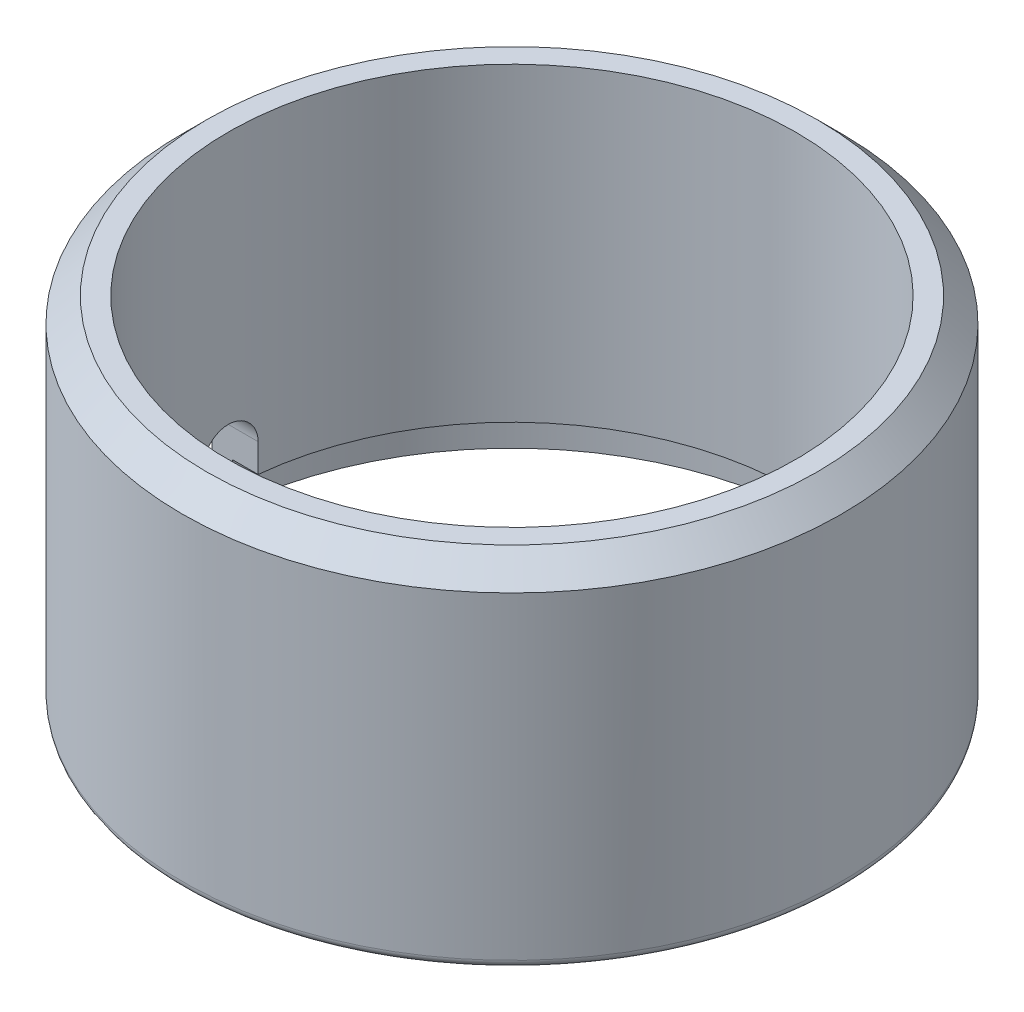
ISO-10303-21;
HEADER;
FILE_DESCRIPTION(('STEP AP214'),'2;1');
FILE_NAME('part.step','',(''),(''),'','','');
FILE_SCHEMA(('AUTOMOTIVE_DESIGN { 1 0 10303 214 1 1 1 1 }'));
ENDSEC;
DATA;
#1=APPLICATION_CONTEXT('core data for automotive mechanical design processes');
#2=APPLICATION_PROTOCOL_DEFINITION('international standard','automotive_design',2000,#1);
#3=PRODUCT_CONTEXT('',#1,'mechanical');
#4=PRODUCT('Part','Part','',(#3));
#5=PRODUCT_RELATED_PRODUCT_CATEGORY('part','',(#4));
#6=PRODUCT_DEFINITION_FORMATION('','',#4);
#7=PRODUCT_DEFINITION_CONTEXT('part definition',#1,'design');
#8=PRODUCT_DEFINITION('design','',#6,#7);
#9=PRODUCT_DEFINITION_SHAPE('','',#8);
#10=(LENGTH_UNIT() NAMED_UNIT(*) SI_UNIT(.MILLI.,.METRE.));
#11=(NAMED_UNIT(*) PLANE_ANGLE_UNIT() SI_UNIT($,.RADIAN.));
#12=(NAMED_UNIT(*) SI_UNIT($,.STERADIAN.) SOLID_ANGLE_UNIT());
#13=UNCERTAINTY_MEASURE_WITH_UNIT(LENGTH_MEASURE(1.E-05),#10,'distance_accuracy_value','');
#14=(GEOMETRIC_REPRESENTATION_CONTEXT(3) GLOBAL_UNCERTAINTY_ASSIGNED_CONTEXT((#13)) GLOBAL_UNIT_ASSIGNED_CONTEXT((#10,
#11,#12)) REPRESENTATION_CONTEXT('',''));
#15=CARTESIAN_POINT('',(0.,0.,0.));
#16=DIRECTION('',(0.,0.,1.));
#17=DIRECTION('',(1.,0.,0.));
#18=AXIS2_PLACEMENT_3D('',#15,#16,#17);
#19=CARTESIAN_POINT('',(0.,21.6,0.));
#20=DIRECTION('',(0.,-1.,0.));
#21=DIRECTION('',(0.,0.,-1.));
#22=AXIS2_PLACEMENT_3D('',#19,#20,#21);
#23=CYLINDRICAL_SURFACE('',#22,17.475);
#24=CARTESIAN_POINT('',(0.,21.6,0.));
#25=DIRECTION('',(0.,-1.,0.));
#26=DIRECTION('',(0.,0.,-1.));
#27=AXIS2_PLACEMENT_3D('',#24,#25,#26);
#28=CIRCLE('',#27,17.475);
#29=CARTESIAN_POINT('',(0.,21.6,-17.475));
#30=VERTEX_POINT('',#29);
#31=EDGE_CURVE('E231',#30,#30,#28,.T.);
#32=ORIENTED_EDGE('',*,*,#31,.F.);
#33=EDGE_LOOP('',(#32));
#34=FACE_BOUND('',#33,.T.);
#35=CARTESIAN_POINT('',(-17.3871540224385,4.24999999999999,-1.75));
#36=CARTESIAN_POINT('',(-17.3871528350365,4.29910463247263,-1.74999981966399));
#37=CARTESIAN_POINT('',(-17.3873623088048,4.34818562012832,-1.74793190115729));
#38=CARTESIAN_POINT('',(-17.3881900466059,4.44599394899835,-1.73968309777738));
#39=CARTESIAN_POINT('',(-17.3888082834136,4.49472131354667,-1.73350248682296));
#40=CARTESIAN_POINT('',(-17.3912543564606,4.63974372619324,-1.70885548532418));
#41=CARTESIAN_POINT('',(-17.3936736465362,4.73506354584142,-1.68428373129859));
#42=CARTESIAN_POINT('',(-17.3998189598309,4.92019736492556,-1.61955831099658));
#43=CARTESIAN_POINT('',(-17.4035454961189,5.01000918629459,-1.57939852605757));
#44=CARTESIAN_POINT('',(-17.4118838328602,5.18162297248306,-1.48464792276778));
#45=CARTESIAN_POINT('',(-17.4164955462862,5.26342572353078,-1.43005852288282));
#46=CARTESIAN_POINT('',(-17.4261027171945,5.41697650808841,-1.30779578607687));
#47=CARTESIAN_POINT('',(-17.4310993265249,5.48869239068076,-1.24008217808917));
#48=CARTESIAN_POINT('',(-17.4409037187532,5.61977390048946,-1.09356381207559));
#49=CARTESIAN_POINT('',(-17.4457114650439,5.67913714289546,-1.01475691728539));
#50=CARTESIAN_POINT('',(-17.4546082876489,5.78393877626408,-0.848085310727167));
#51=CARTESIAN_POINT('',(-17.4586956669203,5.82934446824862,-0.760199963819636));
#52=CARTESIAN_POINT('',(-17.4656749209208,5.90471813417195,-0.578022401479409));
#53=CARTESIAN_POINT('',(-17.468567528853,5.93469557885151,-0.483734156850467));
#54=CARTESIAN_POINT('',(-17.4721108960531,5.97097076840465,-0.324065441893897));
#55=CARTESIAN_POINT('',(-17.4731890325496,5.98184864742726,-0.259697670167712));
#56=CARTESIAN_POINT('',(-17.474635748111,5.99636310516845,-0.130229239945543));
#57=CARTESIAN_POINT('',(-17.4750052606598,6.00000921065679,-0.0651296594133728));
#58=CARTESIAN_POINT('',(-17.475,6.,0.));
#59=B_SPLINE_CURVE_WITH_KNOTS('',3,(#35,#36,#37,#38,#39,#40,#41,#42,#43,#44,#45,#46,#47,#48,#49,
#50,#51,#52,#53,#54,#55,#56,#57,#58),.UNSPECIFIED.,.F.,.F.,(4,2,2,2,2,2,2,2,2,2,2,4),(0.,
0.147223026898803,0.294436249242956,0.588316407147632,0.882312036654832,1.17627877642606,
1.4711622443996,1.76610259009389,2.06172873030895,2.35717318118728,2.55265859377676,
2.74788631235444),.UNSPECIFIED.);
#60=CARTESIAN_POINT('',(-17.3871540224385,4.24999999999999,-1.75));
#61=VERTEX_POINT('',#60);
#62=CARTESIAN_POINT('',(-17.475,6.,0.));
#63=VERTEX_POINT('',#62);
#64=EDGE_CURVE('E178',#61,#63,#59,.T.);
#65=ORIENTED_EDGE('',*,*,#64,.F.);
#66=DIRECTION('',(0.,-1.,0.));
#67=VECTOR('',#66,1.);
#68=CARTESIAN_POINT('',(-17.3871540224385,21.6,-1.75));
#69=LINE('',#68,#67);
#70=CARTESIAN_POINT('',(-17.3871540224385,2.5,-1.75));
#71=VERTEX_POINT('',#70);
#72=EDGE_CURVE('E262',#71,#61,#69,.F.);
#73=ORIENTED_EDGE('',*,*,#72,.F.);
#74=CARTESIAN_POINT('',(0.,2.5,0.));
#75=DIRECTION('',(0.,-1.,0.));
#76=DIRECTION('',(0.,0.,-1.));
#77=AXIS2_PLACEMENT_3D('',#74,#75,#76);
#78=CIRCLE('',#77,17.475);
#79=CARTESIAN_POINT('',(-17.3871540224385,2.5,1.75));
#80=VERTEX_POINT('',#79);
#81=EDGE_CURVE('E235',#80,#71,#78,.F.);
#82=ORIENTED_EDGE('',*,*,#81,.F.);
#83=DIRECTION('',(0.,-1.,0.));
#84=VECTOR('',#83,1.);
#85=CARTESIAN_POINT('',(-17.3871540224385,21.6,1.75));
#86=LINE('',#85,#84);
#87=CARTESIAN_POINT('',(-17.3871540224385,4.25499999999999,1.75));
#88=VERTEX_POINT('',#87);
#89=EDGE_CURVE('E55',#88,#80,#86,.T.);
#90=ORIENTED_EDGE('',*,*,#89,.F.);
#91=CARTESIAN_POINT('',(-17.4749992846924,6.,0.00499999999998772));
#92=CARTESIAN_POINT('',(-17.4749864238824,5.99999981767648,0.0539665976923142));
#93=CARTESIAN_POINT('',(-17.474765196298,5.99793761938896,0.102909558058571));
#94=CARTESIAN_POINT('',(-17.473918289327,5.98971164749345,0.200442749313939));
#95=CARTESIAN_POINT('',(-17.4732926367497,5.98354814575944,0.249033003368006));
#96=CARTESIAN_POINT('',(-17.470830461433,5.95896934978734,0.393647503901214));
#97=CARTESIAN_POINT('',(-17.4684085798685,5.93446557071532,0.488699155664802));
#98=CARTESIAN_POINT('',(-17.4622689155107,5.86991912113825,0.673311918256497));
#99=CARTESIAN_POINT('',(-17.4585506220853,5.82987032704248,0.762870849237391));
#100=CARTESIAN_POINT('',(-17.4502323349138,5.73538169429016,0.934000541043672));
#101=CARTESIAN_POINT('',(-17.4456324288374,5.68094328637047,1.01557209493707));
#102=CARTESIAN_POINT('',(-17.4360464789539,5.55902164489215,1.16868446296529));
#103=CARTESIAN_POINT('',(-17.4310592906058,5.49149878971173,1.24019364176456));
#104=CARTESIAN_POINT('',(-17.421267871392,5.3453940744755,1.37089643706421));
#105=CARTESIAN_POINT('',(-17.4164636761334,5.2668100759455,1.43008766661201));
#106=CARTESIAN_POINT('',(-17.4075685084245,5.10061045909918,1.53458473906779));
#107=CARTESIAN_POINT('',(-17.4034792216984,5.01297424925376,1.57985794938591));
#108=CARTESIAN_POINT('',(-17.3964938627,4.83131360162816,1.6550104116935));
#109=CARTESIAN_POINT('',(-17.3935970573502,4.73729313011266,1.68489912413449));
#110=CARTESIAN_POINT('',(-17.3900482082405,4.57808880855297,1.72106286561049));
#111=CARTESIAN_POINT('',(-17.3889682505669,4.51391494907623,1.73190622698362));
#112=CARTESIAN_POINT('',(-17.3875189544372,4.38483667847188,1.74637463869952));
#113=CARTESIAN_POINT('',(-17.3871486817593,4.31993334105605,1.75000917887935));
#114=CARTESIAN_POINT('',(-17.3871540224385,4.25499999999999,1.75));
#115=B_SPLINE_CURVE_WITH_KNOTS('',3,(#91,#92,#93,#94,#95,#96,#97,#98,#99,#100,#101,#102,#103,
#104,#105,#106,#107,#108,#109,#110,#111,#112,#113,#114),.UNSPECIFIED.,.F.,.F.,(4,2,2,2,2,2,2,2,
2,2,2,4),(0.,0.146809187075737,0.293608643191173,0.586663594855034,0.879834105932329,
1.17297547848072,1.46701880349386,1.76111905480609,2.05590369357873,2.35050684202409,
2.54540282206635,2.74004206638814),.UNSPECIFIED.);
#116=CARTESIAN_POINT('',(-17.4749992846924,6.,0.00499999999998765));
#117=VERTEX_POINT('',#116);
#118=EDGE_CURVE('E135',#117,#88,#115,.T.);
#119=ORIENTED_EDGE('',*,*,#118,.F.);
#120=CARTESIAN_POINT('',(0.,6.,0.));
#121=DIRECTION('',(0.,1.,0.));
#122=DIRECTION('',(0.,0.,1.));
#123=AXIS2_PLACEMENT_3D('',#120,#121,#122);
#124=CIRCLE('',#123,17.475);
#125=EDGE_CURVE('E109',#63,#117,#124,.T.);
#126=ORIENTED_EDGE('',*,*,#125,.F.);
#127=EDGE_LOOP('',(#65,#73,#82,#90,#119,#126));
#128=FACE_BOUND('',#127,.T.);
#129=ADVANCED_FACE('F32',(#34,#128),#23,.F.);
#130=CARTESIAN_POINT('',(0.,21.6,0.));
#131=DIRECTION('',(0.,-1.,0.));
#132=DIRECTION('',(0.,0.,-1.));
#133=AXIS2_PLACEMENT_3D('',#130,#131,#132);
#134=CYLINDRICAL_SURFACE('',#133,20.3);
#135=CARTESIAN_POINT('',(0.,0.5,0.));
#136=DIRECTION('',(0.,1.,0.));
#137=DIRECTION('',(0.,0.,1.));
#138=AXIS2_PLACEMENT_3D('',#135,#136,#137);
#139=CIRCLE('',#138,20.3);
#140=CARTESIAN_POINT('',(-20.2244282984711,0.5,1.75));
#141=VERTEX_POINT('',#140);
#142=CARTESIAN_POINT('',(-20.2244282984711,0.5,-1.75));
#143=VERTEX_POINT('',#142);
#144=EDGE_CURVE('E40',#141,#143,#139,.T.);
#145=ORIENTED_EDGE('',*,*,#144,.T.);
#146=DIRECTION('',(0.,-1.,0.));
#147=VECTOR('',#146,1.);
#148=CARTESIAN_POINT('',(-20.2244282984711,21.6,-1.75));
#149=LINE('',#148,#147);
#150=CARTESIAN_POINT('',(-20.2244282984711,4.24999999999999,-1.75));
#151=VERTEX_POINT('',#150);
#152=EDGE_CURVE('E114',#151,#143,#149,.T.);
#153=ORIENTED_EDGE('',*,*,#152,.F.);
#154=CARTESIAN_POINT('',(-20.3,6.,0.));
#155=CARTESIAN_POINT('',(-20.3000009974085,5.99999978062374,-0.0491389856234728));
#156=CARTESIAN_POINT('',(-20.2998213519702,5.99792900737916,-0.0982543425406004));
#157=CARTESIAN_POINT('',(-20.2991113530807,5.98966855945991,-0.196131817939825));
#158=CARTESIAN_POINT('',(-20.2985810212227,5.98347913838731,-0.244893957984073));
#159=CARTESIAN_POINT('',(-20.2964823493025,5.95879549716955,-0.390026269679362));
#160=CARTESIAN_POINT('',(-20.2944062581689,5.93418571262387,-0.485421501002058));
#161=CARTESIAN_POINT('',(-20.2891294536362,5.8693534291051,-0.670705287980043));
#162=CARTESIAN_POINT('',(-20.2859282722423,5.82912443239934,-0.760591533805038));
#163=CARTESIAN_POINT('',(-20.2787606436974,5.7342049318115,-0.93233882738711));
#164=CARTESIAN_POINT('',(-20.2747942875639,5.67951614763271,-1.0142008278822));
#165=CARTESIAN_POINT('',(-20.2665298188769,5.55708032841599,-1.16777987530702));
#166=CARTESIAN_POINT('',(-20.2622309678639,5.4893036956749,-1.23947327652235));
#167=CARTESIAN_POINT('',(-20.2537914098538,5.34266313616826,-1.37049428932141));
#168=CARTESIAN_POINT('',(-20.2496507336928,5.26379706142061,-1.42981949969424));
#169=CARTESIAN_POINT('',(-20.2419880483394,5.09706597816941,-1.53449978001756));
#170=CARTESIAN_POINT('',(-20.2384671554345,5.0091851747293,-1.57982975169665));
#171=CARTESIAN_POINT('',(-20.232454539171,4.82704191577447,-1.65505775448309));
#172=CARTESIAN_POINT('',(-20.2299621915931,4.73278337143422,-1.68496514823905));
#173=CARTESIAN_POINT('',(-20.2269124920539,4.57329585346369,-1.72110975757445));
#174=CARTESIAN_POINT('',(-20.2259854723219,4.50907637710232,-1.73193593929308));
#175=CARTESIAN_POINT('',(-20.2247415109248,4.37991380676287,-1.74638069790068));
#176=CARTESIAN_POINT('',(-20.22442375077,4.31497180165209,-1.75000894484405));
#177=CARTESIAN_POINT('',(-20.2244282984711,4.24999999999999,-1.75));
#178=B_SPLINE_CURVE_WITH_KNOTS('',3,(#154,#155,#156,#157,#158,#159,#160,#161,#162,#163,#164,
#165,#166,#167,#168,#169,#170,#171,#172,#173,#174,#175,#176,#177),.UNSPECIFIED.,.F.,.F.,(4,2,2,
2,2,2,2,2,2,2,2,4),(0.,0.147326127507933,0.294643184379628,0.588746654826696,0.882972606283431,
1.17716358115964,1.47202781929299,1.76694925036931,2.06239654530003,2.35766427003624,
2.55268207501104,2.74743770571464),.UNSPECIFIED.);
#179=CARTESIAN_POINT('',(-20.3,6.,0.));
#180=VERTEX_POINT('',#179);
#181=EDGE_CURVE('E130',#180,#151,#178,.T.);
#182=ORIENTED_EDGE('',*,*,#181,.F.);
#183=DIRECTION('',(0.,0.,-1.));
#184=VECTOR('',#183,1.);
#185=CARTESIAN_POINT('',(-20.3,6.,0.00499999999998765));
#186=LINE('',#185,#184);
#187=CARTESIAN_POINT('',(-20.2999993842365,6.,0.00499999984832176));
#188=VERTEX_POINT('',#187);
#189=EDGE_CURVE('E106',#188,#180,#186,.T.);
#190=ORIENTED_EDGE('',*,*,#189,.F.);
#191=CARTESIAN_POINT('',(-20.2244282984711,4.25499999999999,1.75));
#192=CARTESIAN_POINT('',(-20.2244272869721,4.30399815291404,1.74999978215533));
#193=CARTESIAN_POINT('',(-20.2246070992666,4.35297274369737,1.74793496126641));
#194=CARTESIAN_POINT('',(-20.2253176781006,4.45056967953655,1.73969826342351));
#195=CARTESIAN_POINT('',(-20.2258484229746,4.49919204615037,1.73352664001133));
#196=CARTESIAN_POINT('',(-20.2279485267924,4.64390822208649,1.70891400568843));
#197=CARTESIAN_POINT('',(-20.2300258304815,4.73902985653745,1.68437504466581));
#198=CARTESIAN_POINT('',(-20.2353036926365,4.92378215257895,1.6197294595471));
#199=CARTESIAN_POINT('',(-20.2385047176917,5.01341051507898,1.57961636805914));
#200=CARTESIAN_POINT('',(-20.2456688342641,5.18466528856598,1.484970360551));
#201=CARTESIAN_POINT('',(-20.2496318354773,5.26629264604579,1.43043915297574));
#202=CARTESIAN_POINT('',(-20.2578860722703,5.41943321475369,1.30835491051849));
#203=CARTESIAN_POINT('',(-20.262178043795,5.49092266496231,1.24077213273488));
#204=CARTESIAN_POINT('',(-20.2706021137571,5.62157109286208,1.09455069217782));
#205=CARTESIAN_POINT('',(-20.2747341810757,5.68072768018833,1.01590989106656));
#206=CARTESIAN_POINT('',(-20.2823819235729,5.7851102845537,0.84965524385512));
#207=CARTESIAN_POINT('',(-20.2858964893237,5.83031133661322,0.762025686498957));
#208=CARTESIAN_POINT('',(-20.2919039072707,5.90532558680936,0.580403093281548));
#209=CARTESIAN_POINT('',(-20.2943973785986,5.93514811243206,0.486413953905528));
#210=CARTESIAN_POINT('',(-20.2974587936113,5.97119078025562,0.327380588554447));
#211=CARTESIAN_POINT('',(-20.29839305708,5.98198659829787,0.263342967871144));
#212=CARTESIAN_POINT('',(-20.2996571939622,5.99639084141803,0.134546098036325));
#213=CARTESIAN_POINT('',(-20.2999878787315,6.00000891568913,0.0697879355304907));
#214=CARTESIAN_POINT('',(-20.2999993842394,6.,0.0049999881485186));
#215=B_SPLINE_CURVE_WITH_KNOTS('',3,(#191,#192,#193,#194,#195,#196,#197,#198,#199,#200,#201,
#202,#203,#204,#205,#206,#207,#208,#209,#210,#211,#212,#213,#214),.UNSPECIFIED.,.F.,.F.,(4,2,2,
2,2,2,2,2,2,2,2,4),(0.,0.146903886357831,0.293798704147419,0.587058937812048,0.880441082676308,
1.17378847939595,1.4678124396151,1.76189333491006,2.05649730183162,2.35092237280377,
2.5453885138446,2.73959305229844),.UNSPECIFIED.);
#216=CARTESIAN_POINT('',(-20.2244282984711,4.25499999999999,1.75));
#217=VERTEX_POINT('',#216);
#218=EDGE_CURVE('E117',#217,#188,#215,.T.);
#219=ORIENTED_EDGE('',*,*,#218,.F.);
#220=DIRECTION('',(0.,-1.,0.));
#221=VECTOR('',#220,1.);
#222=CARTESIAN_POINT('',(-20.2244282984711,21.6,1.75));
#223=LINE('',#222,#221);
#224=EDGE_CURVE('E123',#141,#217,#223,.F.);
#225=ORIENTED_EDGE('',*,*,#224,.F.);
#226=EDGE_LOOP('',(#145,#153,#182,#190,#219,#225));
#227=FACE_BOUND('',#226,.T.);
#228=CARTESIAN_POINT('',(0.,20.1,0.));
#229=DIRECTION('',(0.,1.,0.));
#230=DIRECTION('',(0.,0.,1.));
#231=AXIS2_PLACEMENT_3D('',#228,#229,#230);
#232=CIRCLE('',#231,20.3);
#233=CARTESIAN_POINT('',(0.,20.1,20.3));
#234=VERTEX_POINT('',#233);
#235=EDGE_CURVE('E227',#234,#234,#232,.F.);
#236=ORIENTED_EDGE('',*,*,#235,.T.);
#237=EDGE_LOOP('',(#236));
#238=FACE_BOUND('',#237,.T.);
#239=ADVANCED_FACE('F126',(#227,#238),#134,.T.);
#240=CARTESIAN_POINT('',(0.,21.6,0.));
#241=DIRECTION('',(0.,1.,0.));
#242=DIRECTION('',(0.,0.,1.));
#243=AXIS2_PLACEMENT_3D('',#240,#241,#242);
#244=PLANE('',#243);
#245=CARTESIAN_POINT('',(0.,21.6,0.));
#246=DIRECTION('',(0.,1.,0.));
#247=DIRECTION('',(0.,0.,1.));
#248=AXIS2_PLACEMENT_3D('',#245,#246,#247);
#249=CIRCLE('',#248,18.8);
#250=CARTESIAN_POINT('',(0.,21.6,18.8));
#251=VERTEX_POINT('',#250);
#252=EDGE_CURVE('E230',#251,#251,#249,.T.);
#253=ORIENTED_EDGE('',*,*,#252,.T.);
#254=EDGE_LOOP('',(#253));
#255=FACE_BOUND('',#254,.T.);
#256=ORIENTED_EDGE('',*,*,#31,.T.);
#257=EDGE_LOOP('',(#256));
#258=FACE_BOUND('',#257,.T.);
#259=ADVANCED_FACE('F211',(#255,#258),#244,.T.);
#260=CARTESIAN_POINT('',(0.,0.,0.));
#261=DIRECTION('',(0.,1.,0.));
#262=DIRECTION('',(0.,0.,1.));
#263=AXIS2_PLACEMENT_3D('',#260,#261,#262);
#264=PLANE('',#263);
#265=CARTESIAN_POINT('',(0.,0.,0.));
#266=DIRECTION('',(0.,-1.,0.));
#267=DIRECTION('',(0.,0.,-1.));
#268=AXIS2_PLACEMENT_3D('',#265,#266,#267);
#269=CIRCLE('',#268,19.05);
#270=CARTESIAN_POINT('',(-18.969449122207,0.,-1.75));
#271=VERTEX_POINT('',#270);
#272=CARTESIAN_POINT('',(-18.969449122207,0.,1.75));
#273=VERTEX_POINT('',#272);
#274=EDGE_CURVE('E249',#271,#273,#269,.T.);
#275=ORIENTED_EDGE('',*,*,#274,.F.);
#276=DIRECTION('',(-1.,0.,0.));
#277=VECTOR('',#276,1.);
#278=CARTESIAN_POINT('',(20.301,0.,-1.75));
#279=LINE('',#278,#277);
#280=CARTESIAN_POINT('',(-19.7225125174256,0.,-1.75));
#281=VERTEX_POINT('',#280);
#282=EDGE_CURVE('E165',#271,#281,#279,.T.);
#283=ORIENTED_EDGE('',*,*,#282,.T.);
#284=CARTESIAN_POINT('',(0.,0.,0.));
#285=DIRECTION('',(0.,1.,0.));
#286=DIRECTION('',(0.,0.,1.));
#287=AXIS2_PLACEMENT_3D('',#284,#285,#286);
#288=CIRCLE('',#287,19.8);
#289=CARTESIAN_POINT('',(-19.7225125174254,0.,1.75));
#290=VERTEX_POINT('',#289);
#291=EDGE_CURVE('E11',#281,#290,#288,.F.);
#292=ORIENTED_EDGE('',*,*,#291,.T.);
#293=DIRECTION('',(-1.,0.,0.));
#294=VECTOR('',#293,1.);
#295=CARTESIAN_POINT('',(20.301,0.,1.75));
#296=LINE('',#295,#294);
#297=EDGE_CURVE('E47',#273,#290,#296,.T.);
#298=ORIENTED_EDGE('',*,*,#297,.F.);
#299=EDGE_LOOP('',(#275,#283,#292,#298));
#300=FACE_BOUND('',#299,.T.);
#301=ADVANCED_FACE('F214',(#300),#264,.F.);
#302=CARTESIAN_POINT('',(0.,21.6,0.));
#303=DIRECTION('',(0.,-1.,0.));
#304=DIRECTION('',(0.,0.,-1.));
#305=AXIS2_PLACEMENT_3D('',#302,#303,#304);
#306=CONICAL_SURFACE('',#305,18.8,0.785398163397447);
#307=ORIENTED_EDGE('',*,*,#235,.F.);
#308=EDGE_LOOP('',(#307));
#309=FACE_BOUND('',#308,.T.);
#310=ORIENTED_EDGE('',*,*,#252,.F.);
#311=EDGE_LOOP('',(#310));
#312=FACE_BOUND('',#311,.T.);
#313=ADVANCED_FACE('F203',(#309,#312),#306,.T.);
#314=CARTESIAN_POINT('',(0.,2.5,0.));
#315=DIRECTION('',(0.,-1.,0.));
#316=DIRECTION('',(0.,0.,-1.));
#317=AXIS2_PLACEMENT_3D('',#314,#315,#316);
#318=PLANE('',#317);
#319=DIRECTION('',(-1.,0.,0.));
#320=VECTOR('',#319,1.);
#321=CARTESIAN_POINT('',(20.301,2.5,-1.75));
#322=LINE('',#321,#320);
#323=CARTESIAN_POINT('',(-18.969449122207,2.5,-1.75));
#324=VERTEX_POINT('',#323);
#325=EDGE_CURVE('E191',#71,#324,#322,.T.);
#326=ORIENTED_EDGE('',*,*,#325,.T.);
#327=CARTESIAN_POINT('',(0.,2.5,0.));
#328=DIRECTION('',(0.,-1.,0.));
#329=DIRECTION('',(0.,0.,-1.));
#330=AXIS2_PLACEMENT_3D('',#327,#328,#329);
#331=CIRCLE('',#330,19.05);
#332=CARTESIAN_POINT('',(-18.969449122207,2.5,1.75));
#333=VERTEX_POINT('',#332);
#334=EDGE_CURVE('E240',#324,#333,#331,.T.);
#335=ORIENTED_EDGE('',*,*,#334,.T.);
#336=DIRECTION('',(1.,0.,0.));
#337=VECTOR('',#336,1.);
#338=CARTESIAN_POINT('',(20.301,2.5,1.75));
#339=LINE('',#338,#337);
#340=EDGE_CURVE('E145',#333,#80,#339,.T.);
#341=ORIENTED_EDGE('',*,*,#340,.T.);
#342=ORIENTED_EDGE('',*,*,#81,.T.);
#343=EDGE_LOOP('',(#326,#335,#341,#342));
#344=FACE_BOUND('',#343,.T.);
#345=ADVANCED_FACE('F198',(#344),#318,.T.);
#346=CARTESIAN_POINT('',(0.,2.5,0.));
#347=DIRECTION('',(0.,-1.,0.));
#348=DIRECTION('',(0.,0.,-1.));
#349=AXIS2_PLACEMENT_3D('',#346,#347,#348);
#350=CYLINDRICAL_SURFACE('',#349,19.05);
#351=ORIENTED_EDGE('',*,*,#334,.F.);
#352=DIRECTION('',(0.,-1.,0.));
#353=VECTOR('',#352,1.);
#354=CARTESIAN_POINT('',(-18.969449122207,2.5,-1.75));
#355=LINE('',#354,#353);
#356=EDGE_CURVE('E144',#271,#324,#355,.F.);
#357=ORIENTED_EDGE('',*,*,#356,.F.);
#358=ORIENTED_EDGE('',*,*,#274,.T.);
#359=DIRECTION('',(0.,-1.,0.));
#360=VECTOR('',#359,1.);
#361=CARTESIAN_POINT('',(-18.969449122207,2.5,1.75));
#362=LINE('',#361,#360);
#363=EDGE_CURVE('E142',#333,#273,#362,.T.);
#364=ORIENTED_EDGE('',*,*,#363,.F.);
#365=EDGE_LOOP('',(#351,#357,#358,#364));
#366=FACE_BOUND('',#365,.T.);
#367=ADVANCED_FACE('F202',(#366),#350,.F.);
#368=CARTESIAN_POINT('',(0.,0.5,0.));
#369=DIRECTION('',(0.,1.,0.));
#370=DIRECTION('',(0.,0.,1.));
#371=AXIS2_PLACEMENT_3D('',#368,#369,#370);
#372=TOROIDAL_SURFACE('',#371,19.8,0.5);
#373=CARTESIAN_POINT('',(-20.0959940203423,0.165962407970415,-1.75));
#374=CARTESIAN_POINT('',(-20.1147713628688,0.186799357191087,-1.75));
#375=CARTESIAN_POINT('',(-20.1318068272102,0.209232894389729,-1.75));
#376=CARTESIAN_POINT('',(-20.161885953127,0.256658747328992,-1.75));
#377=CARTESIAN_POINT('',(-20.1749249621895,0.281654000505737,-1.75));
#378=CARTESIAN_POINT('',(-20.1966132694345,0.333474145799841,-1.75));
#379=CARTESIAN_POINT('',(-20.2052641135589,0.36029838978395,-1.75));
#380=CARTESIAN_POINT('',(-20.2179274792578,0.415012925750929,-1.75));
#381=CARTESIAN_POINT('',(-20.2219411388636,0.442902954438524,-1.75));
#382=CARTESIAN_POINT('',(-20.2252149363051,0.498911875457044,-1.75));
#383=CARTESIAN_POINT('',(-20.2244833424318,0.527030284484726,-1.75));
#384=CARTESIAN_POINT('',(-20.2183070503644,0.582745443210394,-1.75));
#385=CARTESIAN_POINT('',(-20.2128622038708,0.610342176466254,-1.75));
#386=CARTESIAN_POINT('',(-20.1974212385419,0.664215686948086,-1.75));
#387=CARTESIAN_POINT('',(-20.1874274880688,0.690493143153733,-1.75));
#388=CARTESIAN_POINT('',(-20.1631779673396,0.741001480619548,-1.75));
#389=CARTESIAN_POINT('',(-20.1489221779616,0.765232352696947,-1.75));
#390=CARTESIAN_POINT('',(-20.1165283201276,0.811008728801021,-1.75));
#391=CARTESIAN_POINT('',(-20.0983832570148,0.832549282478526,-1.75));
#392=CARTESIAN_POINT('',(-20.0587454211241,0.872291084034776,-1.75));
#393=CARTESIAN_POINT('',(-20.0372525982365,0.890492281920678,-1.75));
#394=CARTESIAN_POINT('',(-19.9914518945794,0.923105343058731,-1.75));
#395=CARTESIAN_POINT('',(-19.9671347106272,0.937504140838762,-1.75));
#396=CARTESIAN_POINT('',(-19.9164346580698,0.962031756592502,-1.75));
#397=CARTESIAN_POINT('',(-19.890051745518,0.972160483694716,-1.75));
#398=CARTESIAN_POINT('',(-19.8358677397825,0.987896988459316,-1.75));
#399=CARTESIAN_POINT('',(-19.8080619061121,0.993488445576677,-1.75));
#400=CARTESIAN_POINT('',(-19.7519064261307,0.999935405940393,-1.75));
#401=CARTESIAN_POINT('',(-19.723556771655,1.0007908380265,-1.75));
#402=CARTESIAN_POINT('',(-19.6670508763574,0.997739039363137,-1.75));
#403=CARTESIAN_POINT('',(-19.6388952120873,0.99382112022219,-1.75));
#404=CARTESIAN_POINT('',(-19.5836411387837,0.981313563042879,-1.75));
#405=CARTESIAN_POINT('',(-19.5565427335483,0.972723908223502,-1.75));
#406=CARTESIAN_POINT('',(-19.5041783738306,0.951113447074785,-1.75));
#407=CARTESIAN_POINT('',(-19.4789121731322,0.938093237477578,-1.75));
#408=CARTESIAN_POINT('',(-19.4309317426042,0.907985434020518,-1.75));
#409=CARTESIAN_POINT('',(-19.4082174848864,0.890897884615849,-1.75));
#410=CARTESIAN_POINT('',(-19.3660499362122,0.853184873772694,-1.75));
#411=CARTESIAN_POINT('',(-19.3465884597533,0.832568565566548,-1.75));
#412=CARTESIAN_POINT('',(-19.3114192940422,0.788350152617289,-1.75));
#413=CARTESIAN_POINT('',(-19.2957115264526,0.764748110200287,-1.75));
#414=CARTESIAN_POINT('',(-19.268560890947,0.715326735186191,-1.75));
#415=CARTESIAN_POINT('',(-19.2571016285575,0.689516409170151,-1.75));
#416=CARTESIAN_POINT('',(-19.2386961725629,0.636333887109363,-1.75));
#417=CARTESIAN_POINT('',(-19.2317498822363,0.608961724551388,-1.75));
#418=CARTESIAN_POINT('',(-19.2225896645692,0.553534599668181,-1.75));
#419=CARTESIAN_POINT('',(-19.2203593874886,0.525482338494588,-1.75));
#420=CARTESIAN_POINT('',(-19.2206474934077,0.469402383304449,-1.75));
#421=CARTESIAN_POINT('',(-19.2231658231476,0.441374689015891,-1.75));
#422=CARTESIAN_POINT('',(-19.2328706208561,0.386180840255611,-1.75));
#423=CARTESIAN_POINT('',(-19.240050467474,0.359013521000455,-1.75));
#424=CARTESIAN_POINT('',(-19.258863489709,0.306267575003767,-1.75));
#425=CARTESIAN_POINT('',(-19.2704966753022,0.280688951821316,-1.75));
#426=CARTESIAN_POINT('',(-19.2978985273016,0.231808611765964,-1.75));
#427=CARTESIAN_POINT('',(-19.3136725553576,0.208509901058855,-1.75));
#428=CARTESIAN_POINT('',(-19.3488959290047,0.164879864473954,-1.75));
#429=CARTESIAN_POINT('',(-19.3683453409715,0.144548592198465,-1.75));
#430=CARTESIAN_POINT('',(-19.4104369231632,0.107355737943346,-1.75));
#431=CARTESIAN_POINT('',(-19.4330897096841,0.0905061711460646,-1.75));
#432=CARTESIAN_POINT('',(-19.480893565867,0.0608316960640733,-1.75));
#433=CARTESIAN_POINT('',(-19.5060446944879,0.0480068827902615,-1.75));
#434=CARTESIAN_POINT('',(-19.5582375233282,0.0266940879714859,-1.75));
#435=CARTESIAN_POINT('',(-19.5852862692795,0.0182233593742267,-1.75));
#436=CARTESIAN_POINT('',(-19.6404191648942,0.00592995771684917,-1.75));
#437=CARTESIAN_POINT('',(-19.6685032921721,0.00210718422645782,-1.75));
#438=CARTESIAN_POINT('',(-19.7249878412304,-0.000788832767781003,-1.75));
#439=CARTESIAN_POINT('',(-19.753388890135,0.000150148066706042,-1.75));
#440=CARTESIAN_POINT('',(-19.809638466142,0.00678192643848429,-1.75));
#441=CARTESIAN_POINT('',(-19.8374868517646,0.0124759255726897,-1.75));
#442=CARTESIAN_POINT('',(-19.8918507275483,0.0284655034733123,-1.75));
#443=CARTESIAN_POINT('',(-19.9183651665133,0.0387646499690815,-1.75));
#444=CARTESIAN_POINT('',(-19.969259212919,0.0636724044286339,-1.75));
#445=CARTESIAN_POINT('',(-19.993641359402,0.0782757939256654,-1.75));
#446=CARTESIAN_POINT('',(-20.0310539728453,0.105220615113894,-1.75));
#447=CARTESIAN_POINT('',(-20.0449414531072,0.116393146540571,-1.75));
#448=CARTESIAN_POINT('',(-20.0714512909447,0.140150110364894,-1.75));
#449=CARTESIAN_POINT('',(-20.0840736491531,0.152734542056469,-1.75));
#450=CARTESIAN_POINT('',(-20.0959940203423,0.165962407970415,-1.75));
#451=B_SPLINE_CURVE_WITH_KNOTS('',3,(#373,#374,#375,#376,#377,#378,#379,#380,#381,#382,#383,
#384,#385,#386,#387,#388,#389,#390,#391,#392,#393,#394,#395,#396,#397,#398,#399,#400,#401,#402,
#403,#404,#405,#406,#407,#408,#409,#410,#411,#412,#413,#414,#415,#416,#417,#418,#419,#420,#421,
#422,#423,#424,#425,#426,#427,#428,#429,#430,#431,#432,#433,#434,#435,#436,#437,#438,#439,#440,
#441,#442,#443,#444,#445,#446,#447,#448,#449,#450),.UNSPECIFIED.,.T.,.F.,(4,2,2,2,2,2,2,2,2,2,2,
2,2,2,2,2,2,2,2,2,2,2,2,2,2,2,2,2,2,2,2,2,2,2,2,2,2,2,4),(0.,0.084083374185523,
0.168264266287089,0.252415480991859,0.336546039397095,0.420530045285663,0.504516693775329,
0.588459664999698,0.672403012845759,0.756498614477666,0.840595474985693,0.924977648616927,
1.00936161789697,1.09404778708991,1.17873522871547,1.26361264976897,1.3484903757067,
1.43335667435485,1.51822204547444,1.60287053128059,1.68751725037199,1.77183384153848,
1.8561486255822,1.94017061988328,2.02419167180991,2.10809363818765,2.19199579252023,
2.27600712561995,2.36001997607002,2.44431807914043,2.52861817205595,2.61324977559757,
2.6978795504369,2.78272669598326,2.86759528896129,2.95252974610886,3.03736164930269,
3.09074010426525,3.14411853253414),.UNSPECIFIED.);
#452=EDGE_CURVE('E160',#281,#143,#451,.T.);
#453=ORIENTED_EDGE('',*,*,#452,.T.);
#454=ORIENTED_EDGE('',*,*,#144,.F.);
#455=CARTESIAN_POINT('',(-20.0959940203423,0.165962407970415,1.75));
#456=CARTESIAN_POINT('',(-20.0771151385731,0.1450165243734,1.75));
#457=CARTESIAN_POINT('',(-20.0564483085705,0.125653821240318,1.75));
#458=CARTESIAN_POINT('',(-20.0121370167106,0.0906606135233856,1.75));
#459=CARTESIAN_POINT('',(-19.9884888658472,0.0750348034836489,1.75));
#460=CARTESIAN_POINT('',(-19.9389193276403,0.0479803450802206,1.75));
#461=CARTESIAN_POINT('',(-19.912999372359,0.0365490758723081,1.75));
#462=CARTESIAN_POINT('',(-19.8596186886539,0.0181920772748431,1.75));
#463=CARTESIAN_POINT('',(-19.8321583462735,0.0112652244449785,1.75));
#464=CARTESIAN_POINT('',(-19.7763969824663,0.00209102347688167,1.75));
#465=CARTESIAN_POINT('',(-19.7480940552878,-0.000144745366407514,1.75));
#466=CARTESIAN_POINT('',(-19.6915125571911,0.000159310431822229,1.75));
#467=CARTESIAN_POINT('',(-19.66323398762,0.00269938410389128,1.75));
#468=CARTESIAN_POINT('',(-19.6074621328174,0.0124920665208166,1.75));
#469=CARTESIAN_POINT('',(-19.5799700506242,0.0197515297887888,1.75));
#470=CARTESIAN_POINT('',(-19.5265967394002,0.0387876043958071,1.75));
#471=CARTESIAN_POINT('',(-19.5007155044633,0.050564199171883,1.75));
#472=CARTESIAN_POINT('',(-19.4513299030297,0.0782909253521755,1.75));
#473=CARTESIAN_POINT('',(-19.4278230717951,0.0942366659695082,1.75));
#474=CARTESIAN_POINT('',(-19.3838311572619,0.129860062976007,1.75));
#475=CARTESIAN_POINT('',(-19.3633460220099,0.149537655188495,1.75));
#476=CARTESIAN_POINT('',(-19.3260507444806,0.19200002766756,1.75));
#477=CARTESIAN_POINT('',(-19.3092290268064,0.21477464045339,1.75));
#478=CARTESIAN_POINT('',(-19.2796658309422,0.262833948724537,1.75));
#479=CARTESIAN_POINT('',(-19.2669242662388,0.288118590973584,1.75));
#480=CARTESIAN_POINT('',(-19.2459355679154,0.3403725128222,1.75));
#481=CARTESIAN_POINT('',(-19.2376708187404,0.367334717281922,1.75));
#482=CARTESIAN_POINT('',(-19.2257999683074,0.422265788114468,1.75));
#483=CARTESIAN_POINT('',(-19.2221937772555,0.45023463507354,1.75));
#484=CARTESIAN_POINT('',(-19.2197490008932,0.506298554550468,1.75));
#485=CARTESIAN_POINT('',(-19.2208966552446,0.534393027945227,1.75));
#486=CARTESIAN_POINT('',(-19.2278948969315,0.589989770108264,1.75));
#487=CARTESIAN_POINT('',(-19.2337454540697,0.617492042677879,1.75));
#488=CARTESIAN_POINT('',(-19.249975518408,0.671111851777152,1.75));
#489=CARTESIAN_POINT('',(-19.2603529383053,0.697230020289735,1.75));
#490=CARTESIAN_POINT('',(-19.2853361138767,0.74735873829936,1.75));
#491=CARTESIAN_POINT('',(-19.2999419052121,0.771369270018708,1.75));
#492=CARTESIAN_POINT('',(-19.3329984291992,0.816659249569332,1.75));
#493=CARTESIAN_POINT('',(-19.351457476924,0.83793262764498,1.75));
#494=CARTESIAN_POINT('',(-19.3916729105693,0.877092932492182,1.75));
#495=CARTESIAN_POINT('',(-19.4134293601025,0.894979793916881,1.75));
#496=CARTESIAN_POINT('',(-19.4597099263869,0.926931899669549,1.75));
#497=CARTESIAN_POINT('',(-19.484244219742,0.940982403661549,1.75));
#498=CARTESIAN_POINT('',(-19.5353170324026,0.964782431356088,1.75));
#499=CARTESIAN_POINT('',(-19.5618555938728,0.974531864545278,1.75));
#500=CARTESIAN_POINT('',(-19.6162879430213,0.989488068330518,1.75));
#501=CARTESIAN_POINT('',(-19.6441863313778,0.994678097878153,1.75));
#502=CARTESIAN_POINT('',(-19.700458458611,1.00031070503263,1.75));
#503=CARTESIAN_POINT('',(-19.7288322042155,1.00075321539,1.75));
#504=CARTESIAN_POINT('',(-19.7853069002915,0.996874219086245,1.75));
#505=CARTESIAN_POINT('',(-19.8134072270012,0.992543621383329,1.75));
#506=CARTESIAN_POINT('',(-19.8684813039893,0.979223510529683,1.75));
#507=CARTESIAN_POINT('',(-19.8954550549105,0.970234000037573,1.75));
#508=CARTESIAN_POINT('',(-19.9474906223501,0.947853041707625,1.75));
#509=CARTESIAN_POINT('',(-19.9725536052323,0.934464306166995,1.75));
#510=CARTESIAN_POINT('',(-20.0200677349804,0.90365793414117,1.75));
#511=CARTESIAN_POINT('',(-20.0425189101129,0.886240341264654,1.75));
#512=CARTESIAN_POINT('',(-20.0841036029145,0.847920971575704,1.75));
#513=CARTESIAN_POINT('',(-20.1032461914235,0.827029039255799,1.75));
#514=CARTESIAN_POINT('',(-20.1377365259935,0.78231759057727,1.75));
#515=CARTESIAN_POINT('',(-20.1530843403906,0.758498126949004,1.75));
#516=CARTESIAN_POINT('',(-20.1794897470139,0.708701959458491,1.75));
#517=CARTESIAN_POINT('',(-20.1905629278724,0.682733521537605,1.75));
#518=CARTESIAN_POINT('',(-20.2081767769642,0.629303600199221,1.75));
#519=CARTESIAN_POINT('',(-20.2147177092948,0.601842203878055,1.75));
#520=CARTESIAN_POINT('',(-20.2230640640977,0.546297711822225,1.75));
#521=CARTESIAN_POINT('',(-20.2248843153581,0.518216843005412,1.75));
#522=CARTESIAN_POINT('',(-20.2237786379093,0.462141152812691,1.75));
#523=CARTESIAN_POINT('',(-20.2208515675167,0.434146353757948,1.75));
#524=CARTESIAN_POINT('',(-20.2103398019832,0.379067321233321,1.75));
#525=CARTESIAN_POINT('',(-20.2027581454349,0.351982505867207,1.75));
#526=CARTESIAN_POINT('',(-20.1831632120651,0.299492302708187,1.75));
#527=CARTESIAN_POINT('',(-20.1711552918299,0.274084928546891,1.75));
#528=CARTESIAN_POINT('',(-20.1484212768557,0.234877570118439,1.75));
#529=CARTESIAN_POINT('',(-20.1389447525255,0.220338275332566,1.75));
#530=CARTESIAN_POINT('',(-20.1185355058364,0.192320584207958,1.75));
#531=CARTESIAN_POINT('',(-20.1076027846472,0.178842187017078,1.75));
#532=CARTESIAN_POINT('',(-20.0959940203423,0.165962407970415,1.75));
#533=B_SPLINE_CURVE_WITH_KNOTS('',3,(#455,#456,#457,#458,#459,#460,#461,#462,#463,#464,#465,
#466,#467,#468,#469,#470,#471,#472,#473,#474,#475,#476,#477,#478,#479,#480,#481,#482,#483,#484,
#485,#486,#487,#488,#489,#490,#491,#492,#493,#494,#495,#496,#497,#498,#499,#500,#501,#502,#503,
#504,#505,#506,#507,#508,#509,#510,#511,#512,#513,#514,#515,#516,#517,#518,#519,#520,#521,#522,
#523,#524,#525,#526,#527,#528,#529,#530,#531,#532),.UNSPECIFIED.,.T.,.F.,(4,2,2,2,2,2,2,2,2,2,2,
2,2,2,2,2,2,2,2,2,2,2,2,2,2,2,2,2,2,2,2,2,2,2,2,2,2,2,4),(0.,0.084531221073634,
0.169168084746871,0.253751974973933,0.338314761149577,0.423086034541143,0.507861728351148,
0.592760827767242,0.677659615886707,0.762469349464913,0.84727762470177,0.93181391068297,
1.01634840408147,1.10054780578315,1.18474558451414,1.26869981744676,1.35265351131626,
1.43656853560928,1.52048426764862,1.60458299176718,1.68868333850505,1.77310241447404,
1.85752326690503,1.94225281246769,2.026983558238,2.11187596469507,2.19676832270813,
2.281608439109,2.36644763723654,2.45105041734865,2.53565167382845,2.61994142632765,
2.70422626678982,2.78824602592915,2.87228599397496,2.95627115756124,3.04015501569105,
3.09213393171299,3.14411280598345),.UNSPECIFIED.);
#534=EDGE_CURVE('E146',#141,#290,#533,.T.);
#535=ORIENTED_EDGE('',*,*,#534,.T.);
#536=ORIENTED_EDGE('',*,*,#291,.F.);
#537=EDGE_LOOP('',(#453,#454,#535,#536));
#538=FACE_BOUND('',#537,.T.);
#539=ADVANCED_FACE('F34',(#538),#372,.T.);
#540=CARTESIAN_POINT('',(20.301,4.255,0.00500000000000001));
#541=DIRECTION('',(-1.,0.,0.));
#542=DIRECTION('',(0.,0.,1.));
#543=AXIS2_PLACEMENT_3D('',#540,#541,#542);
#544=CYLINDRICAL_SURFACE('',#543,1.745);
#545=ORIENTED_EDGE('',*,*,#118,.T.);
#546=DIRECTION('',(-1.,0.,0.));
#547=VECTOR('',#546,1.);
#548=CARTESIAN_POINT('',(20.301,4.25499999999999,1.75));
#549=LINE('',#548,#547);
#550=EDGE_CURVE('E119',#88,#217,#549,.T.);
#551=ORIENTED_EDGE('',*,*,#550,.T.);
#552=ORIENTED_EDGE('',*,*,#218,.T.);
#553=DIRECTION('',(-1.,0.,0.));
#554=VECTOR('',#553,1.);
#555=CARTESIAN_POINT('',(20.301,6.,0.00499999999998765));
#556=LINE('',#555,#554);
#557=EDGE_CURVE('E102',#117,#188,#556,.T.);
#558=ORIENTED_EDGE('',*,*,#557,.F.);
#559=EDGE_LOOP('',(#545,#551,#552,#558));
#560=FACE_BOUND('',#559,.T.);
#561=ADVANCED_FACE('F118',(#560),#544,.F.);
#562=CARTESIAN_POINT('',(20.301,6.,0.00499999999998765));
#563=DIRECTION('',(0.,1.,0.));
#564=DIRECTION('',(0.,0.,1.));
#565=AXIS2_PLACEMENT_3D('',#562,#563,#564);
#566=PLANE('',#565);
#567=ORIENTED_EDGE('',*,*,#125,.T.);
#568=ORIENTED_EDGE('',*,*,#557,.T.);
#569=ORIENTED_EDGE('',*,*,#189,.T.);
#570=DIRECTION('',(-1.,0.,0.));
#571=VECTOR('',#570,1.);
#572=CARTESIAN_POINT('',(20.301,6.,0.));
#573=LINE('',#572,#571);
#574=EDGE_CURVE('E113',#63,#180,#573,.T.);
#575=ORIENTED_EDGE('',*,*,#574,.F.);
#576=EDGE_LOOP('',(#567,#568,#569,#575));
#577=FACE_BOUND('',#576,.T.);
#578=ADVANCED_FACE('F104',(#577),#566,.F.);
#579=CARTESIAN_POINT('',(20.301,4.25,0.));
#580=DIRECTION('',(-1.,0.,0.));
#581=DIRECTION('',(0.,0.,1.));
#582=AXIS2_PLACEMENT_3D('',#579,#580,#581);
#583=CYLINDRICAL_SURFACE('',#582,1.75);
#584=ORIENTED_EDGE('',*,*,#64,.T.);
#585=ORIENTED_EDGE('',*,*,#574,.T.);
#586=ORIENTED_EDGE('',*,*,#181,.T.);
#587=DIRECTION('',(-1.,0.,0.));
#588=VECTOR('',#587,1.);
#589=CARTESIAN_POINT('',(20.301,4.24999999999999,-1.75));
#590=LINE('',#589,#588);
#591=EDGE_CURVE('E252',#61,#151,#590,.T.);
#592=ORIENTED_EDGE('',*,*,#591,.F.);
#593=EDGE_LOOP('',(#584,#585,#586,#592));
#594=FACE_BOUND('',#593,.T.);
#595=ADVANCED_FACE('F170',(#594),#583,.F.);
#596=CARTESIAN_POINT('',(20.301,0.,-1.75));
#597=DIRECTION('',(0.,0.,-1.));
#598=DIRECTION('',(-1.,0.,0.));
#599=AXIS2_PLACEMENT_3D('',#596,#597,#598);
#600=PLANE('',#599);
#601=ORIENTED_EDGE('',*,*,#72,.T.);
#602=ORIENTED_EDGE('',*,*,#591,.T.);
#603=ORIENTED_EDGE('',*,*,#152,.T.);
#604=ORIENTED_EDGE('',*,*,#452,.F.);
#605=ORIENTED_EDGE('',*,*,#282,.F.);
#606=ORIENTED_EDGE('',*,*,#356,.T.);
#607=ORIENTED_EDGE('',*,*,#325,.F.);
#608=EDGE_LOOP('',(#601,#602,#603,#604,#605,#606,#607));
#609=FACE_BOUND('',#608,.T.);
#610=ADVANCED_FACE('F166',(#609),#600,.F.);
#611=CARTESIAN_POINT('',(20.301,0.,1.75));
#612=DIRECTION('',(0.,0.,1.));
#613=DIRECTION('',(1.,0.,0.));
#614=AXIS2_PLACEMENT_3D('',#611,#612,#613);
#615=PLANE('',#614);
#616=ORIENTED_EDGE('',*,*,#89,.T.);
#617=ORIENTED_EDGE('',*,*,#340,.F.);
#618=ORIENTED_EDGE('',*,*,#363,.T.);
#619=ORIENTED_EDGE('',*,*,#297,.T.);
#620=ORIENTED_EDGE('',*,*,#534,.F.);
#621=ORIENTED_EDGE('',*,*,#224,.T.);
#622=ORIENTED_EDGE('',*,*,#550,.F.);
#623=EDGE_LOOP('',(#616,#617,#618,#619,#620,#621,#622));
#624=FACE_BOUND('',#623,.T.);
#625=ADVANCED_FACE('F153',(#624),#615,.F.);
#626=CLOSED_SHELL('',(#129,#239,#259,#301,#313,#345,#367,#539,#561,#578,#595,#610,#625));
#627=MANIFOLD_SOLID_BREP('B2',#626);
#628=ADVANCED_BREP_SHAPE_REPRESENTATION('',(#18,#627),#14);
#629=SHAPE_DEFINITION_REPRESENTATION(#9,#628);
ENDSEC;
END-ISO-10303-21;
